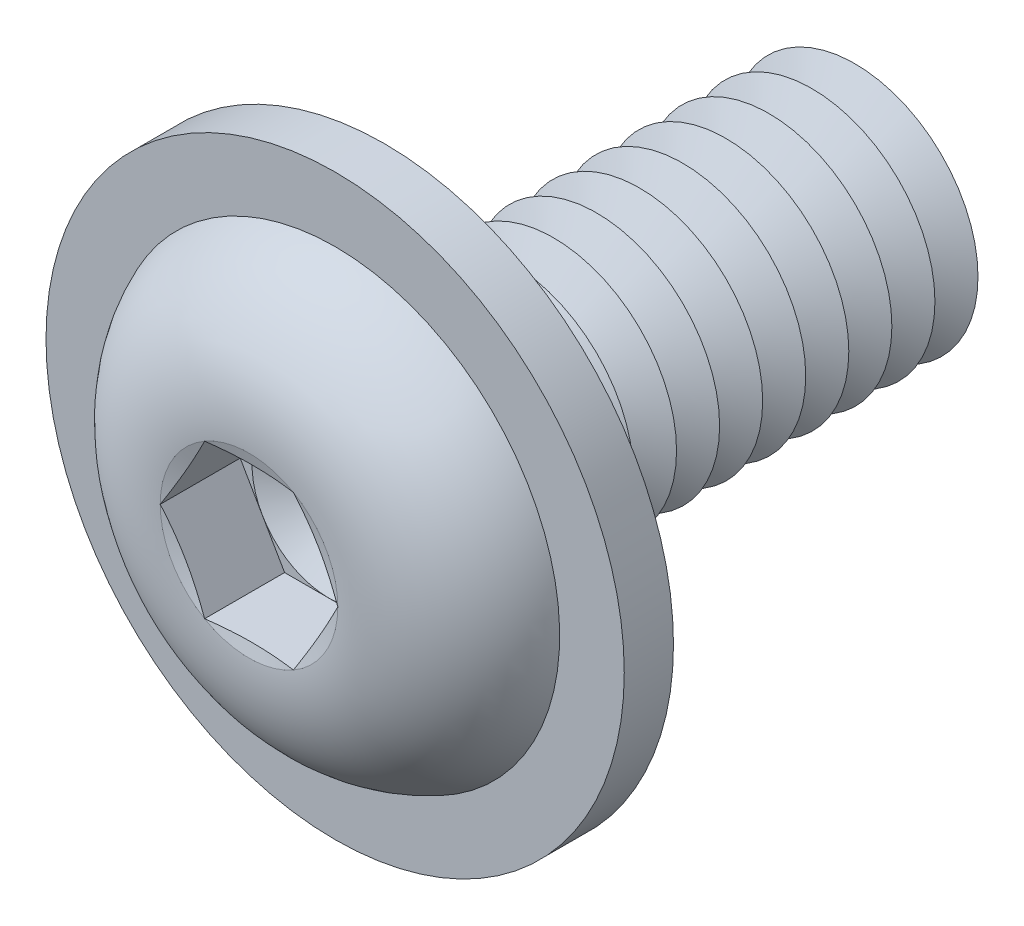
from build123d import *

# Parameters (mm, degrees)
FILLET1_R           = 0.35
LPATTERN1_COUNT     = 11
LPATTERN1_PITCH     = 0.7
CUT_EXTRUDE1_DEPTH  = 1.3
SKETCH5_R           = 4.7
SKETCH5_R_2         = 2.35
BOSS_EXTRUDE1_DEPTH = 0.8


with BuildPart() as part:
    # Sketch1 → Revolve1 (revolve)
    with BuildSketch(Plane(origin=(0, 0, 0), x_dir=(0, 0, -1), z_dir=(1, 0, 0)), mode=Mode.PRIVATE) as revolve1_sk:
        with BuildLine():
            Line((0, 2), (0, 3.8))
            ThreePointArc((0, 3.8), (-1.611961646, 3.099623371), (-2.2, 1.443375))
            Line((-2.2, 1.443375), (-2.006624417, 0.7216875))
            Line((-2.006624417, 0.7216875), (-2.2, 0.7216875))
            Line((-2.2, 0.7216875), (-2.2, 0))
            Line((-2.2, 0), (8, 0))
            Line((8, 0), (8, 2))
            Line((8, 2), (0, 2))
        make_face()
    revolve(revolve1_sk.sketch.rotate(Axis((0, 0, -8), (0, 0, 1)), 90), axis=Axis((0, 0, -8), (0, 0, 1)))

    # Fillet1
    fillet1_edges = [part.edges().sort_by_distance(p)[0] for p in [
        (2, 0, 0),
    ]]
    fillet(fillet1_edges, radius=FILLET1_R)

    # Sketch2 → Cut-Revolve1 (revolve, cut)
    with BuildSketch(Plane(origin=(0, 0, 0), x_dir=(0, 0, -1), z_dir=(1, 0, 0)), mode=Mode.PRIVATE) as cut_revolve1_sk:
        Polygon((7.65, 2), (8.35, 2), (8, 1.393782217), align=None)
    cut_revolve1 = revolve(cut_revolve1_sk.sketch.rotate(Axis((0, 0, -8), (0, 0, -1)), 270), axis=Axis((0, 0, -8), (0, 0, -1)), mode=Mode.SUBTRACT)

    # LPattern1: Cut-Revolve1 ×11
    with Locations(*[(0, 0, i * LPATTERN1_PITCH) for i in range(1, LPATTERN1_COUNT)]):
        add(cut_revolve1, mode=Mode.SUBTRACT)

    # Sketch3 → Cut-Extrude1 (cut)
    with BuildSketch(Plane.XY.offset(2.2)):
        Polygon((0.7216875, 1.249999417), (-0.7216875, 1.249999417), (-1.443375, 0), (-0.7216875, -1.249999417), (0.7216875, -1.249999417), (1.443375, 0), align=None)
    extrude(amount=-CUT_EXTRUDE1_DEPTH, mode=Mode.SUBTRACT)

    # Cut-Extrude2 cone 1 section (on through the dimple's axis) → Cut-Extrude2 (revolve, cut)
    with BuildSketch(Plane(origin=(0, 0, 0.9), x_dir=(0, -1, 0), z_dir=(1, 0, 0))):
        Polygon((0, 0), (1.249999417, 0), (0, 0.7216875), align=None)
    revolve(axis=Axis((0, 0, 0.9), (0, 0, -1)), mode=Mode.SUBTRACT)

    # Sketch5 → Boss-Extrude1 (add)
    with BuildSketch(Plane(origin=(0, 0, 0), x_dir=(-1, 0, 0), z_dir=(0, 0, -1))):
        with Locations(Location((0, 0, 0), (0, 0, 90))):
            Circle(SKETCH5_R)
        Circle(SKETCH5_R_2, mode=Mode.SUBTRACT)
    extrude(amount=-BOSS_EXTRUDE1_DEPTH)


solid = part.part
